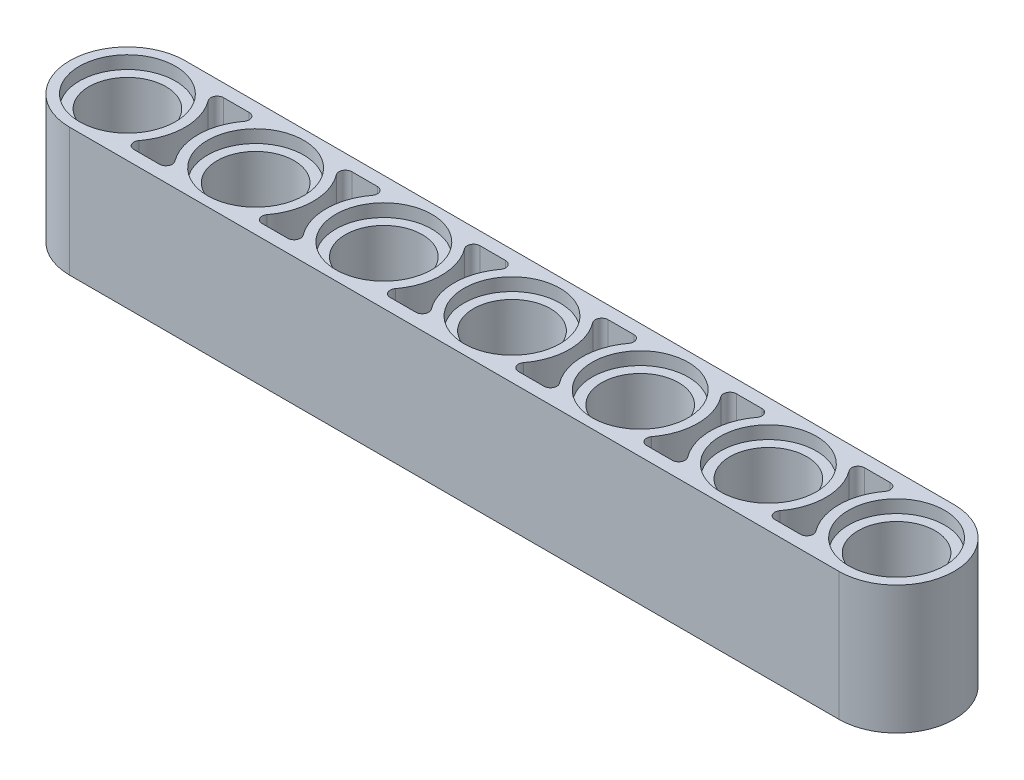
from build123d import *

# Parameters (mm, degrees)
SKETCH1_R           = 2.4
BOSS_EXTRUDE1_DEPTH = 8
SKETCH2_R           = 3
CUT_EXTRUDE1_DEPTH  = 0.8
CUT_EXTRUDE2_START  = -3.2
CUT_EXTRUDE2_DEPTH  = 3.2
CUT_EXTRUDE3_START  = -8
CUT_EXTRUDE3_DEPTH  = 8
CUT_EXTRUDE4_START  = -8
CUT_EXTRUDE4_DEPTH  = 8
CUT_EXTRUDE5_START  = -8
CUT_EXTRUDE5_DEPTH  = 8
CUT_EXTRUDE6_START  = -8
CUT_EXTRUDE6_DEPTH  = 8


with BuildPart() as part:
    # Sketch1 → Boss-Extrude1 (new body)
    with BuildSketch(Plane(origin=(0, 0, 0), x_dir=(1, 0, 0), z_dir=(0, 1, 0))):
        with BuildLine():
            Line((0, -3.6), (112, -3.6))
            ThreePointArc((112, -3.6), (115.6, 0), (112, 3.6))
            Line((112, 3.6), (0, 3.6))
            ThreePointArc((0, 3.6), (-3.6, 0), (0, -3.6))
        make_face()
        with Locations(Location((0, 0, 0), (0, 0, 270))):
            Circle(SKETCH1_R, mode=Mode.SUBTRACT)
        with Locations(Location((8, 0, 0), (0, 0, 270))):
            Circle(SKETCH1_R, mode=Mode.SUBTRACT)
        with Locations(Location((16, 0, 0), (0, 0, 270))):
            Circle(SKETCH1_R, mode=Mode.SUBTRACT)
        with Locations(Location((24, 0, 0), (0, 0, 270))):
            Circle(SKETCH1_R, mode=Mode.SUBTRACT)
        with Locations(Location((32, 0, 0), (0, 0, 270))):
            Circle(SKETCH1_R, mode=Mode.SUBTRACT)
        with Locations(Location((40, 0, 0), (0, 0, 270))):
            Circle(SKETCH1_R, mode=Mode.SUBTRACT)
        with Locations(Location((48, 0, 0), (0, 0, 270))):
            Circle(SKETCH1_R, mode=Mode.SUBTRACT)
        with Locations(Location((56, 0, 0), (0, 0, 270))):
            Circle(SKETCH1_R, mode=Mode.SUBTRACT)
        with Locations(Location((64, 0, 0), (0, 0, 270))):
            Circle(SKETCH1_R, mode=Mode.SUBTRACT)
        with Locations(Location((72, 0, 0), (0, 0, 270))):
            Circle(SKETCH1_R, mode=Mode.SUBTRACT)
        with Locations(Location((80, 0, 0), (0, 0, 270))):
            Circle(SKETCH1_R, mode=Mode.SUBTRACT)
        with Locations(Location((88, 0, 0), (0, 0, 270))):
            Circle(SKETCH1_R, mode=Mode.SUBTRACT)
        with Locations(Location((96, 0, 0), (0, 0, 270))):
            Circle(SKETCH1_R, mode=Mode.SUBTRACT)
        with Locations(Location((104, 0, 0), (0, 0, 270))):
            Circle(SKETCH1_R, mode=Mode.SUBTRACT)
        with Locations(Location((112, 0, 0), (0, 0, 270))):
            Circle(SKETCH1_R, mode=Mode.SUBTRACT)
    extrude(amount=BOSS_EXTRUDE1_DEPTH)

    # Sketch2 → Cut-Extrude1 (cut)
    with BuildSketch(Plane(origin=(0, 8, 0), x_dir=(1, 0, 0), z_dir=(0, 1, 0))):
        with Locations(Location((0, 0, 0), (0, 0, 270))):
            Circle(SKETCH2_R)
        with Locations(Location((8, 0, 0), (0, 0, 270))):
            Circle(SKETCH2_R)
        with Locations(Location((16, 0, 0), (0, 0, 270))):
            Circle(SKETCH2_R)
        with Locations(Location((24, 0, 0), (0, 0, 270))):
            Circle(SKETCH2_R)
        with Locations(Location((32, 0, 0), (0, 0, 270))):
            Circle(SKETCH2_R)
        with Locations(Location((40, 0, 0), (0, 0, 270))):
            Circle(SKETCH2_R)
        with Locations(Location((48, 0, 0), (0, 0, 270))):
            Circle(SKETCH2_R)
        with Locations(Location((56, 0, 0), (0, 0, 270))):
            Circle(SKETCH2_R)
        with Locations(Location((64, 0, 0), (0, 0, 270))):
            Circle(SKETCH2_R)
        with Locations(Location((72, 0, 0), (0, 0, 270))):
            Circle(SKETCH2_R)
        with Locations(Location((80, 0, 0), (0, 0, 270))):
            Circle(SKETCH2_R)
        with Locations(Location((88, 0, 0), (0, 0, 270))):
            Circle(SKETCH2_R)
        with Locations(Location((96, 0, 0), (0, 0, 270))):
            Circle(SKETCH2_R)
        with Locations(Location((104, 0, 0), (0, 0, 270))):
            Circle(SKETCH2_R)
        with Locations(Location((112, 0, 0), (0, 0, 270))):
            Circle(SKETCH2_R)
    cut_extrude1 = extrude(amount=-CUT_EXTRUDE1_DEPTH, mode=Mode.SUBTRACT)

    # Sketch3 → Cut-Extrude2 (cut)
    with BuildSketch(Plane(origin=(0, 8, 0), x_dir=(1, 0, 0), z_dir=(0, 1, 0)).offset(CUT_EXTRUDE2_START)):
        with BuildLine():
            Line((3.2, 2.8), (4.8, 2.8))
            ThreePointArc((4.8, 2.8), (5.157770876, 2.578885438), (5.12, 2.16))
            ThreePointArc((5.12, 2.16), (4.4, 0), (5.12, -2.16))
            ThreePointArc((5.12, -2.16), (5.157770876, -2.578885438), (4.8, -2.8))
            Line((4.8, -2.8), (3.2, -2.8))
            ThreePointArc((3.2, -2.8), (2.842229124, -2.578885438), (2.88, -2.16))
            ThreePointArc((2.88, -2.16), (3.6, 0), (2.88, 2.16))
            ThreePointArc((2.88, 2.16), (2.842229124, 2.578885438), (3.2, 2.8))
        make_face()
        with BuildLine():
            Line((11.2, 2.8), (12.8, 2.8))
            ThreePointArc((12.8, 2.8), (13.157770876, 2.578885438), (13.12, 2.16))
            ThreePointArc((13.12, 2.16), (12.4, 0), (13.12, -2.16))
            ThreePointArc((13.12, -2.16), (13.157770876, -2.578885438), (12.8, -2.8))
            Line((12.8, -2.8), (11.2, -2.8))
            ThreePointArc((11.2, -2.8), (10.842229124, -2.578885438), (10.88, -2.16))
            ThreePointArc((10.88, -2.16), (11.6, 0), (10.88, 2.16))
            ThreePointArc((10.88, 2.16), (10.842229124, 2.578885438), (11.2, 2.8))
        make_face()
        with BuildLine():
            Line((19.2, 2.8), (20.8, 2.8))
            ThreePointArc((20.8, 2.8), (21.157770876, 2.578885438), (21.12, 2.16))
            ThreePointArc((21.12, 2.16), (20.4, 0), (21.12, -2.16))
            ThreePointArc((21.12, -2.16), (21.157770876, -2.578885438), (20.8, -2.8))
            Line((20.8, -2.8), (19.2, -2.8))
            ThreePointArc((19.2, -2.8), (18.842229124, -2.578885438), (18.88, -2.16))
            ThreePointArc((18.88, -2.16), (19.6, 0), (18.88, 2.16))
            ThreePointArc((18.88, 2.16), (18.842229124, 2.578885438), (19.2, 2.8))
        make_face()
        with BuildLine():
            Line((27.2, 2.8), (28.8, 2.8))
            ThreePointArc((28.8, 2.8), (29.157770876, 2.578885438), (29.12, 2.16))
            ThreePointArc((29.12, 2.16), (28.4, 0), (29.12, -2.16))
            ThreePointArc((29.12, -2.16), (29.157770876, -2.578885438), (28.8, -2.8))
            Line((28.8, -2.8), (27.2, -2.8))
            ThreePointArc((27.2, -2.8), (26.842229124, -2.578885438), (26.88, -2.16))
            ThreePointArc((26.88, -2.16), (27.6, 0), (26.88, 2.16))
            ThreePointArc((26.88, 2.16), (26.842229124, 2.578885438), (27.2, 2.8))
        make_face()
        with BuildLine():
            Line((35.2, 2.8), (36.8, 2.8))
            ThreePointArc((36.8, 2.8), (37.157770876, 2.578885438), (37.12, 2.16))
            ThreePointArc((37.12, 2.16), (36.4, 0), (37.12, -2.16))
            ThreePointArc((37.12, -2.16), (37.157770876, -2.578885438), (36.8, -2.8))
            Line((36.8, -2.8), (35.2, -2.8))
            ThreePointArc((35.2, -2.8), (34.842229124, -2.578885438), (34.88, -2.16))
            ThreePointArc((34.88, -2.16), (35.6, 0), (34.88, 2.16))
            ThreePointArc((34.88, 2.16), (34.842229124, 2.578885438), (35.2, 2.8))
        make_face()
        with BuildLine():
            Line((43.2, 2.8), (44.8, 2.8))
            ThreePointArc((44.8, 2.8), (45.157770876, 2.578885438), (45.12, 2.16))
            ThreePointArc((45.12, 2.16), (44.4, 0), (45.12, -2.16))
            ThreePointArc((45.12, -2.16), (45.157770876, -2.578885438), (44.8, -2.8))
            Line((44.8, -2.8), (43.2, -2.8))
            ThreePointArc((43.2, -2.8), (42.842229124, -2.578885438), (42.88, -2.16))
            ThreePointArc((42.88, -2.16), (43.6, 0), (42.88, 2.16))
            ThreePointArc((42.88, 2.16), (42.842229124, 2.578885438), (43.2, 2.8))
        make_face()
        with BuildLine():
            Line((51.2, 2.8), (52.8, 2.8))
            ThreePointArc((52.8, 2.8), (53.157770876, 2.578885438), (53.12, 2.16))
            ThreePointArc((53.12, 2.16), (52.4, 0), (53.12, -2.16))
            ThreePointArc((53.12, -2.16), (53.157770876, -2.578885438), (52.8, -2.8))
            Line((52.8, -2.8), (51.2, -2.8))
            ThreePointArc((51.2, -2.8), (50.842229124, -2.578885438), (50.88, -2.16))
            ThreePointArc((50.88, -2.16), (51.6, 0), (50.88, 2.16))
            ThreePointArc((50.88, 2.16), (50.842229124, 2.578885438), (51.2, 2.8))
        make_face()
        with BuildLine():
            Line((59.2, 2.8), (60.8, 2.8))
            ThreePointArc((60.8, 2.8), (61.157770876, 2.578885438), (61.12, 2.16))
            ThreePointArc((61.12, 2.16), (60.4, 0), (61.12, -2.16))
            ThreePointArc((61.12, -2.16), (61.157770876, -2.578885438), (60.8, -2.8))
            Line((60.8, -2.8), (59.2, -2.8))
            ThreePointArc((59.2, -2.8), (58.842229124, -2.578885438), (58.88, -2.16))
            ThreePointArc((58.88, -2.16), (59.6, 0), (58.88, 2.16))
            ThreePointArc((58.88, 2.16), (58.842229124, 2.578885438), (59.2, 2.8))
        make_face()
        with BuildLine():
            Line((67.2, 2.8), (68.8, 2.8))
            ThreePointArc((68.8, 2.8), (69.157770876, 2.578885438), (69.12, 2.16))
            ThreePointArc((69.12, 2.16), (68.4, 0), (69.12, -2.16))
            ThreePointArc((69.12, -2.16), (69.157770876, -2.578885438), (68.8, -2.8))
            Line((68.8, -2.8), (67.2, -2.8))
            ThreePointArc((67.2, -2.8), (66.842229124, -2.578885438), (66.88, -2.16))
            ThreePointArc((66.88, -2.16), (67.6, 0), (66.88, 2.16))
            ThreePointArc((66.88, 2.16), (66.842229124, 2.578885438), (67.2, 2.8))
        make_face()
        with BuildLine():
            Line((75.2, 2.8), (76.8, 2.8))
            ThreePointArc((76.8, 2.8), (77.157770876, 2.578885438), (77.12, 2.16))
            ThreePointArc((77.12, 2.16), (76.4, 0), (77.12, -2.16))
            ThreePointArc((77.12, -2.16), (77.157770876, -2.578885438), (76.8, -2.8))
            Line((76.8, -2.8), (75.2, -2.8))
            ThreePointArc((75.2, -2.8), (74.842229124, -2.578885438), (74.88, -2.16))
            ThreePointArc((74.88, -2.16), (75.6, 0), (74.88, 2.16))
            ThreePointArc((74.88, 2.16), (74.842229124, 2.578885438), (75.2, 2.8))
        make_face()
        with BuildLine():
            Line((83.2, 2.8), (84.8, 2.8))
            ThreePointArc((84.8, 2.8), (85.157770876, 2.578885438), (85.12, 2.16))
            ThreePointArc((85.12, 2.16), (84.4, 0), (85.12, -2.16))
            ThreePointArc((85.12, -2.16), (85.157770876, -2.578885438), (84.8, -2.8))
            Line((84.8, -2.8), (83.2, -2.8))
            ThreePointArc((83.2, -2.8), (82.842229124, -2.578885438), (82.88, -2.16))
            ThreePointArc((82.88, -2.16), (83.6, 0), (82.88, 2.16))
            ThreePointArc((82.88, 2.16), (82.842229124, 2.578885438), (83.2, 2.8))
        make_face()
        with BuildLine():
            Line((91.2, 2.8), (92.8, 2.8))
            ThreePointArc((92.8, 2.8), (93.157770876, 2.578885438), (93.12, 2.16))
            ThreePointArc((93.12, 2.16), (92.4, 0), (93.12, -2.16))
            ThreePointArc((93.12, -2.16), (93.157770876, -2.578885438), (92.8, -2.8))
            Line((92.8, -2.8), (91.2, -2.8))
            ThreePointArc((91.2, -2.8), (90.842229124, -2.578885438), (90.88, -2.16))
            ThreePointArc((90.88, -2.16), (91.6, 0), (90.88, 2.16))
            ThreePointArc((90.88, 2.16), (90.842229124, 2.578885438), (91.2, 2.8))
        make_face()
        with BuildLine():
            Line((99.2, 2.8), (100.8, 2.8))
            ThreePointArc((100.8, 2.8), (101.157770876, 2.578885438), (101.12, 2.16))
            ThreePointArc((101.12, 2.16), (100.4, 0), (101.12, -2.16))
            ThreePointArc((101.12, -2.16), (101.157770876, -2.578885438), (100.8, -2.8))
            Line((100.8, -2.8), (99.2, -2.8))
            ThreePointArc((99.2, -2.8), (98.842229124, -2.578885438), (98.88, -2.16))
            ThreePointArc((98.88, -2.16), (99.6, 0), (98.88, 2.16))
            ThreePointArc((98.88, 2.16), (98.842229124, 2.578885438), (99.2, 2.8))
        make_face()
        with BuildLine():
            Line((107.2, 2.8), (108.8, 2.8))
            ThreePointArc((108.8, 2.8), (109.157770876, 2.578885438), (109.12, 2.16))
            ThreePointArc((109.12, 2.16), (108.4, 0), (109.12, -2.16))
            ThreePointArc((109.12, -2.16), (109.157770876, -2.578885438), (108.8, -2.8))
            Line((108.8, -2.8), (107.2, -2.8))
            ThreePointArc((107.2, -2.8), (106.842229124, -2.578885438), (106.88, -2.16))
            ThreePointArc((106.88, -2.16), (107.6, 0), (106.88, 2.16))
            ThreePointArc((106.88, 2.16), (106.842229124, 2.578885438), (107.2, 2.8))
        make_face()
    cut_extrude2 = extrude(amount=CUT_EXTRUDE2_DEPTH, mode=Mode.SUBTRACT)

    # Mirror1: Cut-Extrude1, Cut-Extrude2 across plane
    add(cut_extrude1.mirror(Plane.ZX.offset(4)), mode=Mode.SUBTRACT)
    add(cut_extrude2.mirror(Plane.ZX.offset(4)), mode=Mode.SUBTRACT)

    # Sketch4 → Cut-Extrude3 (cut)
    with BuildSketch(Plane(origin=(0, 8, 0), x_dir=(1, 0, 0), z_dir=(0, 1, 0)).offset(CUT_EXTRUDE3_START)):
        with BuildLine():
            Line((96, 3.6), (112, 3.6))
            ThreePointArc((112, 3.6), (115.6, 0), (112, -3.6))
            Line((112, -3.6), (96, -3.6))
            ThreePointArc((96, -3.6), (99.6, 0), (96, 3.6))
        make_face()
    extrude(amount=CUT_EXTRUDE3_DEPTH, mode=Mode.SUBTRACT)

    # Sketch5 → Cut-Extrude4 (cut)
    with BuildSketch(Plane(origin=(0, 8, 0), x_dir=(1, 0, 0), z_dir=(0, 1, 0)).offset(CUT_EXTRUDE4_START)):
        with BuildLine():
            Line((80, 3.6), (96, 3.6))
            ThreePointArc((96, 3.6), (99.6, 0), (96, -3.6))
            Line((96, -3.6), (80, -3.6))
            ThreePointArc((80, -3.6), (83.6, 0), (80, 3.6))
        make_face()
    extrude(amount=CUT_EXTRUDE4_DEPTH, mode=Mode.SUBTRACT)

    # Sketch6 → Cut-Extrude5 (cut)
    with BuildSketch(Plane(origin=(0, 8, 0), x_dir=(1, 0, 0), z_dir=(0, 1, 0)).offset(CUT_EXTRUDE5_START)):
        with BuildLine():
            Line((64, 3.6), (80, 3.6))
            ThreePointArc((80, 3.6), (83.6, 0), (80, -3.6))
            Line((80, -3.6), (64, -3.6))
            ThreePointArc((64, -3.6), (67.6, 0), (64, 3.6))
        make_face()
    extrude(amount=CUT_EXTRUDE5_DEPTH, mode=Mode.SUBTRACT)

    # Sketch7 → Cut-Extrude6 (cut)
    with BuildSketch(Plane(origin=(0, 8, 0), x_dir=(1, 0, 0), z_dir=(0, 1, 0)).offset(CUT_EXTRUDE6_START)):
        with BuildLine():
            Line((48, 3.6), (64, 3.6))
            ThreePointArc((64, 3.6), (67.6, 0), (64, -3.6))
            Line((64, -3.6), (48, -3.6))
            ThreePointArc((48, -3.6), (51.6, 0), (48, 3.6))
        make_face()
    extrude(amount=CUT_EXTRUDE6_DEPTH, mode=Mode.SUBTRACT)


solid = part.part
